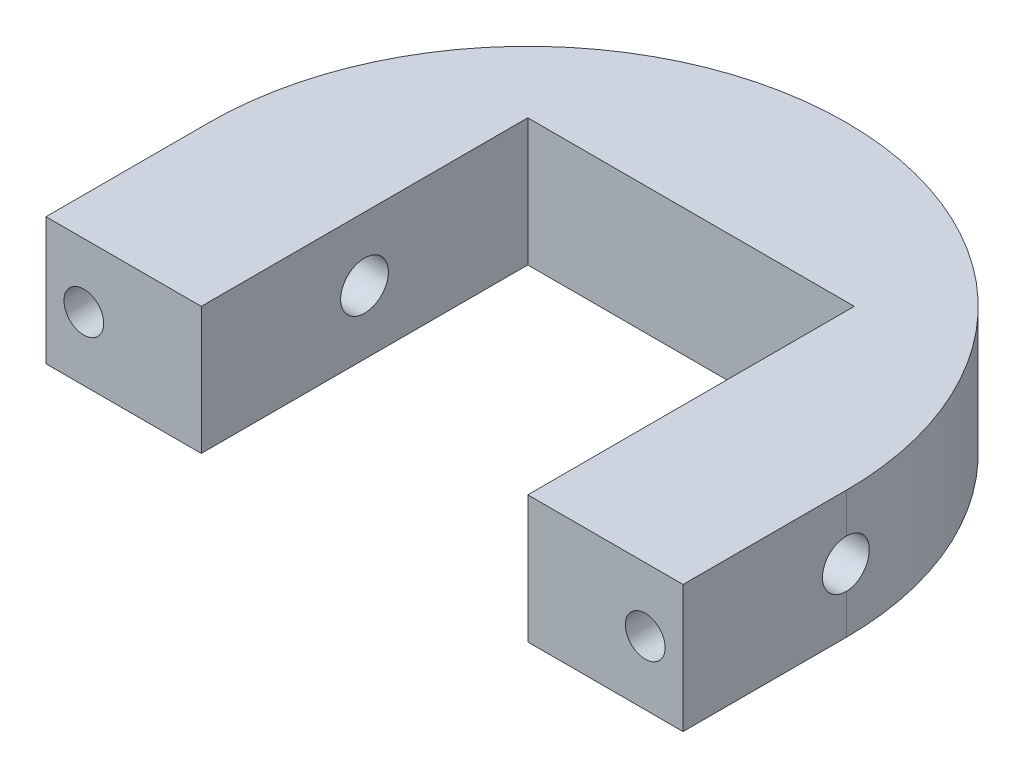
ISO-10303-21;
HEADER;
FILE_DESCRIPTION(('STEP AP214'),'2;1');
FILE_NAME('part.step','',(''),(''),'','','');
FILE_SCHEMA(('AUTOMOTIVE_DESIGN { 1 0 10303 214 1 1 1 1 }'));
ENDSEC;
DATA;
#1=APPLICATION_CONTEXT('core data for automotive mechanical design processes');
#2=APPLICATION_PROTOCOL_DEFINITION('international standard','automotive_design',2000,#1);
#3=PRODUCT_CONTEXT('',#1,'mechanical');
#4=PRODUCT('Part','Part','',(#3));
#5=PRODUCT_RELATED_PRODUCT_CATEGORY('part','',(#4));
#6=PRODUCT_DEFINITION_FORMATION('','',#4);
#7=PRODUCT_DEFINITION_CONTEXT('part definition',#1,'design');
#8=PRODUCT_DEFINITION('design','',#6,#7);
#9=PRODUCT_DEFINITION_SHAPE('','',#8);
#10=(LENGTH_UNIT() NAMED_UNIT(*) SI_UNIT(.MILLI.,.METRE.));
#11=(NAMED_UNIT(*) PLANE_ANGLE_UNIT() SI_UNIT($,.RADIAN.));
#12=(NAMED_UNIT(*) SI_UNIT($,.STERADIAN.) SOLID_ANGLE_UNIT());
#13=UNCERTAINTY_MEASURE_WITH_UNIT(LENGTH_MEASURE(1.E-05),#10,'distance_accuracy_value','');
#14=(GEOMETRIC_REPRESENTATION_CONTEXT(3) GLOBAL_UNCERTAINTY_ASSIGNED_CONTEXT((#13)) GLOBAL_UNIT_ASSIGNED_CONTEXT((#10,
#11,#12)) REPRESENTATION_CONTEXT('',''));
#15=CARTESIAN_POINT('',(0.,0.,0.));
#16=DIRECTION('',(0.,0.,1.));
#17=DIRECTION('',(1.,0.,0.));
#18=AXIS2_PLACEMENT_3D('',#15,#16,#17);
#19=CARTESIAN_POINT('',(35.25,8.,7.87476235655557));
#20=DIRECTION('',(0.,0.,1.));
#21=DIRECTION('',(1.,0.,0.));
#22=AXIS2_PLACEMENT_3D('',#19,#20,#21);
#23=CONICAL_SURFACE('',#22,2.49999999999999,1.02974425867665);
#24=CARTESIAN_POINT('',(35.25,8.,6.37261080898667));
#25=VERTEX_POINT('',#24);
#26=VERTEX_LOOP('',#25);
#27=FACE_BOUND('',#26,.T.);
#28=CARTESIAN_POINT('',(35.25,8.,7.87476235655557));
#29=DIRECTION('',(0.,0.,1.));
#30=DIRECTION('',(1.,0.,0.));
#31=AXIS2_PLACEMENT_3D('',#28,#29,#30);
#32=CIRCLE('',#31,2.49999999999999);
#33=CARTESIAN_POINT('',(37.75,8.,7.87476235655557));
#34=VERTEX_POINT('',#33);
#35=EDGE_CURVE('E210',#34,#34,#32,.T.);
#36=ORIENTED_EDGE('',*,*,#35,.T.);
#37=EDGE_LOOP('',(#36));
#38=FACE_BOUND('',#37,.T.);
#39=ADVANCED_FACE('F33',(#27,#38),#23,.F.);
#40=CARTESIAN_POINT('',(35.25,8.,32.8747623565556));
#41=DIRECTION('',(0.,0.,1.));
#42=DIRECTION('',(1.,0.,0.));
#43=AXIS2_PLACEMENT_3D('',#40,#41,#42);
#44=CYLINDRICAL_SURFACE('',#43,2.49999999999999);
#45=CARTESIAN_POINT('',(35.25,8.,20.5));
#46=DIRECTION('',(0.,0.,-1.));
#47=DIRECTION('',(-1.,0.,0.));
#48=AXIS2_PLACEMENT_3D('',#45,#46,#47);
#49=CIRCLE('',#48,2.49999999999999);
#50=CARTESIAN_POINT('',(32.75,8.,20.5));
#51=VERTEX_POINT('',#50);
#52=EDGE_CURVE('E202',#51,#51,#49,.F.);
#53=ORIENTED_EDGE('',*,*,#52,.T.);
#54=EDGE_LOOP('',(#53));
#55=FACE_BOUND('',#54,.T.);
#56=ORIENTED_EDGE('',*,*,#35,.F.);
#57=EDGE_LOOP('',(#56));
#58=FACE_BOUND('',#57,.T.);
#59=ADVANCED_FACE('F256',(#55,#58),#44,.F.);
#60=CARTESIAN_POINT('',(40.,-15.,20.5));
#61=DIRECTION('',(0.,0.,-1.));
#62=DIRECTION('',(-1.,0.,0.));
#63=AXIS2_PLACEMENT_3D('',#60,#61,#62);
#64=PLANE('',#63);
#65=DIRECTION('',(-1.,0.,0.));
#66=VECTOR('',#65,1.);
#67=CARTESIAN_POINT('',(0.,16.,20.5));
#68=LINE('',#67,#66);
#69=CARTESIAN_POINT('',(40.,16.,20.5));
#70=VERTEX_POINT('',#69);
#71=CARTESIAN_POINT('',(20.5,16.,20.5));
#72=VERTEX_POINT('',#71);
#73=EDGE_CURVE('E205',#70,#72,#68,.T.);
#74=ORIENTED_EDGE('',*,*,#73,.T.);
#75=DIRECTION('',(0.,1.,0.));
#76=VECTOR('',#75,1.);
#77=CARTESIAN_POINT('',(20.5,0.,20.5));
#78=LINE('',#77,#76);
#79=CARTESIAN_POINT('',(20.5,0.,20.5));
#80=VERTEX_POINT('',#79);
#81=EDGE_CURVE('E175',#80,#72,#78,.T.);
#82=ORIENTED_EDGE('',*,*,#81,.F.);
#83=DIRECTION('',(-1.,0.,0.));
#84=VECTOR('',#83,1.);
#85=CARTESIAN_POINT('',(0.,0.,20.5));
#86=LINE('',#85,#84);
#87=CARTESIAN_POINT('',(40.,0.,20.5));
#88=VERTEX_POINT('',#87);
#89=EDGE_CURVE('E58',#88,#80,#86,.T.);
#90=ORIENTED_EDGE('',*,*,#89,.F.);
#91=DIRECTION('',(0.,1.,0.));
#92=VECTOR('',#91,1.);
#93=CARTESIAN_POINT('',(40.,-15.,20.5));
#94=LINE('',#93,#92);
#95=EDGE_CURVE('E134',#88,#70,#94,.T.);
#96=ORIENTED_EDGE('',*,*,#95,.T.);
#97=EDGE_LOOP('',(#74,#82,#90,#96));
#98=FACE_BOUND('',#97,.T.);
#99=ORIENTED_EDGE('',*,*,#52,.F.);
#100=EDGE_LOOP('',(#99));
#101=FACE_BOUND('',#100,.T.);
#102=ADVANCED_FACE('F261',(#98,#101),#64,.F.);
#103=CARTESIAN_POINT('',(0.,16.,0.));
#104=DIRECTION('',(0.,-1.,0.));
#105=DIRECTION('',(0.,0.,-1.));
#106=AXIS2_PLACEMENT_3D('',#103,#104,#105);
#107=CYLINDRICAL_SURFACE('',#106,40.);
#108=DIRECTION('',(0.,1.,0.));
#109=VECTOR('',#108,1.);
#110=CARTESIAN_POINT('',(40.,-86.4913290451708,0.));
#111=LINE('',#110,#109);
#112=CARTESIAN_POINT('',(40.,11.,0.));
#113=VERTEX_POINT('',#112);
#114=CARTESIAN_POINT('',(40.,16.,0.));
#115=VERTEX_POINT('',#114);
#116=EDGE_CURVE('E145',#113,#115,#111,.T.);
#117=ORIENTED_EDGE('',*,*,#116,.F.);
#118=CARTESIAN_POINT('',(40.,11.,0.));
#119=CARTESIAN_POINT('',(40.0000025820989,11.0000082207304,-0.0842519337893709));
#120=CARTESIAN_POINT('',(39.999733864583,10.9964508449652,-0.168499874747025));
#121=CARTESIAN_POINT('',(39.998672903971,10.9822685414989,-0.336390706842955));
#122=CARTESIAN_POINT('',(39.997880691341,10.9716440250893,-0.420033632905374));
#123=CARTESIAN_POINT('',(39.9957926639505,10.9434026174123,-0.586059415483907));
#124=CARTESIAN_POINT('',(39.9944972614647,10.9257914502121,-0.668443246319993));
#125=CARTESIAN_POINT('',(39.9914417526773,10.883721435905,-0.831410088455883));
#126=CARTESIAN_POINT('',(39.989681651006,10.8592626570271,-0.911993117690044));
#127=CARTESIAN_POINT('',(39.9837722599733,10.7758194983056,-1.15025422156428));
#128=CARTESIAN_POINT('',(39.9789928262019,10.7067548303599,-1.30452302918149));
#129=CARTESIAN_POINT('',(39.9682934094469,10.543823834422,-1.59916835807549));
#130=CARTESIAN_POINT('',(39.9623736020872,10.4499613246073,-1.73954701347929));
#131=CARTESIAN_POINT('',(39.9500441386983,10.2398690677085,-2.00284405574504));
#132=CARTESIAN_POINT('',(39.9436336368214,10.1236001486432,-2.12573119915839));
#133=CARTESIAN_POINT('',(39.9310518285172,9.87206977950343,-2.35027392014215));
#134=CARTESIAN_POINT('',(39.9248805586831,9.73680543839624,-2.45192625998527));
#135=CARTESIAN_POINT('',(39.9134669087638,9.45094083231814,-2.63120995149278));
#136=CARTESIAN_POINT('',(39.9082256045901,9.30032311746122,-2.70881355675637));
#137=CARTESIAN_POINT('',(39.899274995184,8.98815933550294,-2.83761304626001));
#138=CARTESIAN_POINT('',(39.8955655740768,8.82661409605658,-2.88881092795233));
#139=CARTESIAN_POINT('',(39.8901052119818,8.49749425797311,-2.96326025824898));
#140=CARTESIAN_POINT('',(39.8883506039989,8.3299315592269,-2.98656403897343));
#141=CARTESIAN_POINT('',(39.8869867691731,7.99326026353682,-3.00472522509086));
#142=CARTESIAN_POINT('',(39.8873775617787,7.82415165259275,-2.99958237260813));
#143=CARTESIAN_POINT('',(39.8902571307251,7.48955598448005,-2.96103864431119));
#144=CARTESIAN_POINT('',(39.8927416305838,7.32406225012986,-2.92769536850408));
#145=CARTESIAN_POINT('',(39.8995219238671,7.0010278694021,-2.83378680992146));
#146=CARTESIAN_POINT('',(39.9038177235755,6.84348725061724,-2.77322143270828));
#147=CARTESIAN_POINT('',(39.9137415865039,6.54064304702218,-2.62652168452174));
#148=CARTESIAN_POINT('',(39.9193710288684,6.39535234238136,-2.54036082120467));
#149=CARTESIAN_POINT('',(39.9313261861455,6.12128065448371,-2.34493899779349));
#150=CARTESIAN_POINT('',(39.9376518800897,5.99249917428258,-2.23567873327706));
#151=CARTESIAN_POINT('',(39.9503050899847,5.75477592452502,-1.99685373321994));
#152=CARTESIAN_POINT('',(39.9566325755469,5.64588129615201,-1.86724207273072));
#153=CARTESIAN_POINT('',(39.9685642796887,5.45135495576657,-1.59150157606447));
#154=CARTESIAN_POINT('',(39.9741682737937,5.36573045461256,-1.44536763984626));
#155=CARTESIAN_POINT('',(39.9840229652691,5.22018178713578,-1.14068220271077));
#156=CARTESIAN_POINT('',(39.9882727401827,5.16027512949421,-0.982122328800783));
#157=CARTESIAN_POINT('',(39.9949278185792,5.06803781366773,-0.657276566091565));
#158=CARTESIAN_POINT('',(39.9973359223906,5.03566528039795,-0.491002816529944));
#159=CARTESIAN_POINT('',(39.9991276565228,5.01165189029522,-0.269659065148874));
#160=CARTESIAN_POINT('',(39.9994546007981,5.00728019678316,-0.215772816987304));
#161=CARTESIAN_POINT('',(39.9998904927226,5.00145821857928,-0.107931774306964));
#162=CARTESIAN_POINT('',(39.9999998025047,5.00000308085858,-0.053977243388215));
#163=CARTESIAN_POINT('',(40.,5.,0.));
#164=B_SPLINE_CURVE_WITH_KNOTS('',3,(#118,#119,#120,#121,#122,#123,#124,#125,#126,#127,#128,
#129,#130,#131,#132,#133,#134,#135,#136,#137,#138,#139,#140,#141,#142,#143,#144,#145,#146,#147,
#148,#149,#150,#151,#152,#153,#154,#155,#156,#157,#158,#159,#160,#161,#162,#163),.UNSPECIFIED.,
.F.,.F.,(4,2,2,2,2,2,2,2,2,2,2,2,2,2,2,2,2,2,2,2,2,2,4),(0.,0.252673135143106,0.505331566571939,
0.757783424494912,1.01023276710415,1.51489486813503,2.01947931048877,2.52495402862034,
3.03050576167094,3.53663862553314,4.04273319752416,4.5478767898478,5.0530249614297,
5.55714384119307,6.06126446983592,6.56590871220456,7.07053776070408,7.57634791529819,
8.08231463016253,8.58862526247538,9.09416449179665,9.25630110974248,9.41816771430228),.UNSPECIFIED.);
#165=CARTESIAN_POINT('',(40.,5.,0.));
#166=VERTEX_POINT('',#165);
#167=EDGE_CURVE('E148',#113,#166,#164,.T.);
#168=ORIENTED_EDGE('',*,*,#167,.T.);
#169=CARTESIAN_POINT('',(40.,0.,0.));
#170=VERTEX_POINT('',#169);
#171=EDGE_CURVE('E141',#170,#166,#111,.T.);
#172=ORIENTED_EDGE('',*,*,#171,.F.);
#173=CARTESIAN_POINT('',(0.,0.,0.));
#174=DIRECTION('',(0.,1.,0.));
#175=DIRECTION('',(0.,0.,1.));
#176=AXIS2_PLACEMENT_3D('',#173,#174,#175);
#177=CIRCLE('',#176,40.);
#178=CARTESIAN_POINT('',(-40.,0.,0.));
#179=VERTEX_POINT('',#178);
#180=EDGE_CURVE('E178',#170,#179,#177,.T.);
#181=ORIENTED_EDGE('',*,*,#180,.T.);
#182=DIRECTION('',(0.,1.,0.));
#183=VECTOR('',#182,1.);
#184=CARTESIAN_POINT('',(-40.,-86.4913290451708,0.));
#185=LINE('',#184,#183);
#186=CARTESIAN_POINT('',(-40.,5.,0.));
#187=VERTEX_POINT('',#186);
#188=EDGE_CURVE('E140',#179,#187,#185,.T.);
#189=ORIENTED_EDGE('',*,*,#188,.T.);
#190=CARTESIAN_POINT('',(-40.,5.,0.));
#191=CARTESIAN_POINT('',(-40.0000025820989,4.99999177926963,-0.0842519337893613));
#192=CARTESIAN_POINT('',(-39.999733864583,5.00354915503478,-0.168499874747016));
#193=CARTESIAN_POINT('',(-39.998672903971,5.01773145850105,-0.336390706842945));
#194=CARTESIAN_POINT('',(-39.997880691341,5.0283559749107,-0.420033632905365));
#195=CARTESIAN_POINT('',(-39.9957926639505,5.05659738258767,-0.586059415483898));
#196=CARTESIAN_POINT('',(-39.9944972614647,5.07420854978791,-0.668443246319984));
#197=CARTESIAN_POINT('',(-39.9914417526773,5.11627856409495,-0.831410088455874));
#198=CARTESIAN_POINT('',(-39.989681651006,5.14073734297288,-0.911993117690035));
#199=CARTESIAN_POINT('',(-39.9837722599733,5.22418050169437,-1.15025422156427));
#200=CARTESIAN_POINT('',(-39.9789928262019,5.29324516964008,-1.30452302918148));
#201=CARTESIAN_POINT('',(-39.9682934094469,5.45617616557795,-1.59916835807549));
#202=CARTESIAN_POINT('',(-39.9623736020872,5.55003867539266,-1.73954701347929));
#203=CARTESIAN_POINT('',(-39.9500441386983,5.76013093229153,-2.00284405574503));
#204=CARTESIAN_POINT('',(-39.9436336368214,5.87639985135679,-2.12573119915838));
#205=CARTESIAN_POINT('',(-39.9310518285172,6.12793022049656,-2.35027392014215));
#206=CARTESIAN_POINT('',(-39.9248805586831,6.26319456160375,-2.45192625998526));
#207=CARTESIAN_POINT('',(-39.9134669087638,6.54905916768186,-2.63120995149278));
#208=CARTESIAN_POINT('',(-39.9082256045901,6.69967688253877,-2.70881355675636));
#209=CARTESIAN_POINT('',(-39.899274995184,7.01184066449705,-2.83761304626));
#210=CARTESIAN_POINT('',(-39.8955655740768,7.17338590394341,-2.88881092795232));
#211=CARTESIAN_POINT('',(-39.8901052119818,7.50250574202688,-2.96326025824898));
#212=CARTESIAN_POINT('',(-39.8883506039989,7.67006844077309,-2.98656403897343));
#213=CARTESIAN_POINT('',(-39.8869867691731,8.00673973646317,-3.00472522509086));
#214=CARTESIAN_POINT('',(-39.8873775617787,8.17584834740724,-2.99958237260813));
#215=CARTESIAN_POINT('',(-39.8902571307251,8.51044401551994,-2.96103864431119));
#216=CARTESIAN_POINT('',(-39.8927416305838,8.67593774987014,-2.92769536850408));
#217=CARTESIAN_POINT('',(-39.8995219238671,8.99897213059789,-2.83378680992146));
#218=CARTESIAN_POINT('',(-39.9038177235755,9.15651274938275,-2.77322143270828));
#219=CARTESIAN_POINT('',(-39.9137415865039,9.45935695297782,-2.62652168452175));
#220=CARTESIAN_POINT('',(-39.9193710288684,9.60464765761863,-2.54036082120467));
#221=CARTESIAN_POINT('',(-39.9313261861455,9.87871934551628,-2.3449389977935));
#222=CARTESIAN_POINT('',(-39.9376518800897,10.0075008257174,-2.23567873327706));
#223=CARTESIAN_POINT('',(-39.9503050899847,10.245224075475,-1.99685373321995));
#224=CARTESIAN_POINT('',(-39.9566325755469,10.354118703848,-1.86724207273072));
#225=CARTESIAN_POINT('',(-39.9685642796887,10.5486450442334,-1.59150157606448));
#226=CARTESIAN_POINT('',(-39.9741682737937,10.6342695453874,-1.44536763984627));
#227=CARTESIAN_POINT('',(-39.9840229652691,10.7798182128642,-1.14068220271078));
#228=CARTESIAN_POINT('',(-39.9882727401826,10.8397248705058,-0.982122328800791));
#229=CARTESIAN_POINT('',(-39.9949278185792,10.9319621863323,-0.657276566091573));
#230=CARTESIAN_POINT('',(-39.9973359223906,10.964334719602,-0.491002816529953));
#231=CARTESIAN_POINT('',(-39.9991276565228,10.9883481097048,-0.26965906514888));
#232=CARTESIAN_POINT('',(-39.9994546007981,10.9927198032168,-0.215772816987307));
#233=CARTESIAN_POINT('',(-39.9998904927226,10.9985417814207,-0.107931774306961));
#234=CARTESIAN_POINT('',(-39.9999998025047,10.9999969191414,-0.0539772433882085));
#235=CARTESIAN_POINT('',(-40.,11.,0.));
#236=B_SPLINE_CURVE_WITH_KNOTS('',3,(#190,#191,#192,#193,#194,#195,#196,#197,#198,#199,#200,
#201,#202,#203,#204,#205,#206,#207,#208,#209,#210,#211,#212,#213,#214,#215,#216,#217,#218,#219,
#220,#221,#222,#223,#224,#225,#226,#227,#228,#229,#230,#231,#232,#233,#234,#235),.UNSPECIFIED.,
.F.,.F.,(4,2,2,2,2,2,2,2,2,2,2,2,2,2,2,2,2,2,2,2,2,2,4),(0.,0.252673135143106,0.505331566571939,
0.757783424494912,1.01023276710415,1.51489486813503,2.01947931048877,2.52495402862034,
3.03050576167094,3.53663862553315,4.04273319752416,4.5478767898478,5.0530249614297,
5.55714384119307,6.06126446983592,6.56590871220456,7.07053776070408,7.57634791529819,
8.08231463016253,8.58862526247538,9.09416449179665,9.25630110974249,9.4181677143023),.UNSPECIFIED.);
#237=CARTESIAN_POINT('',(-40.,11.,0.));
#238=VERTEX_POINT('',#237);
#239=EDGE_CURVE('E220',#187,#238,#236,.T.);
#240=ORIENTED_EDGE('',*,*,#239,.T.);
#241=CARTESIAN_POINT('',(-40.,16.,0.));
#242=VERTEX_POINT('',#241);
#243=EDGE_CURVE('E158',#238,#242,#185,.T.);
#244=ORIENTED_EDGE('',*,*,#243,.T.);
#245=CARTESIAN_POINT('',(0.,16.,0.));
#246=DIRECTION('',(0.,1.,0.));
#247=DIRECTION('',(0.,0.,1.));
#248=AXIS2_PLACEMENT_3D('',#245,#246,#247);
#249=CIRCLE('',#248,40.);
#250=EDGE_CURVE('E43',#115,#242,#249,.T.);
#251=ORIENTED_EDGE('',*,*,#250,.F.);
#252=EDGE_LOOP('',(#117,#168,#172,#181,#189,#240,#244,#251));
#253=FACE_BOUND('',#252,.T.);
#254=ADVANCED_FACE('F35',(#253),#107,.T.);
#255=CARTESIAN_POINT('',(0.,16.,0.));
#256=DIRECTION('',(0.,1.,0.));
#257=DIRECTION('',(0.,0.,1.));
#258=AXIS2_PLACEMENT_3D('',#255,#256,#257);
#259=PLANE('',#258);
#260=ORIENTED_EDGE('',*,*,#73,.F.);
#261=DIRECTION('',(0.,0.,-1.));
#262=VECTOR('',#261,1.);
#263=CARTESIAN_POINT('',(40.,16.,0.));
#264=LINE('',#263,#262);
#265=EDGE_CURVE('E157',#70,#115,#264,.T.);
#266=ORIENTED_EDGE('',*,*,#265,.T.);
#267=ORIENTED_EDGE('',*,*,#250,.T.);
#268=DIRECTION('',(0.,0.,1.));
#269=VECTOR('',#268,1.);
#270=CARTESIAN_POINT('',(-40.,16.,0.));
#271=LINE('',#270,#269);
#272=CARTESIAN_POINT('',(-40.,16.,20.5));
#273=VERTEX_POINT('',#272);
#274=EDGE_CURVE('E155',#242,#273,#271,.T.);
#275=ORIENTED_EDGE('',*,*,#274,.T.);
#276=CARTESIAN_POINT('',(-20.5,16.,20.5));
#277=VERTEX_POINT('',#276);
#278=EDGE_CURVE('E50',#277,#273,#68,.T.);
#279=ORIENTED_EDGE('',*,*,#278,.F.);
#280=DIRECTION('',(0.,0.,1.));
#281=VECTOR('',#280,1.);
#282=CARTESIAN_POINT('',(-20.5,16.,20.5));
#283=LINE('',#282,#281);
#284=CARTESIAN_POINT('',(-20.5,16.,-20.5));
#285=VERTEX_POINT('',#284);
#286=EDGE_CURVE('E164',#285,#277,#283,.T.);
#287=ORIENTED_EDGE('',*,*,#286,.F.);
#288=DIRECTION('',(-1.,0.,0.));
#289=VECTOR('',#288,1.);
#290=CARTESIAN_POINT('',(20.5,16.,-20.5));
#291=LINE('',#290,#289);
#292=CARTESIAN_POINT('',(20.5,16.,-20.5));
#293=VERTEX_POINT('',#292);
#294=EDGE_CURVE('E170',#293,#285,#291,.T.);
#295=ORIENTED_EDGE('',*,*,#294,.F.);
#296=DIRECTION('',(0.,0.,-1.));
#297=VECTOR('',#296,1.);
#298=CARTESIAN_POINT('',(20.5,16.,20.5));
#299=LINE('',#298,#297);
#300=EDGE_CURVE('E168',#72,#293,#299,.T.);
#301=ORIENTED_EDGE('',*,*,#300,.F.);
#302=EDGE_LOOP('',(#260,#266,#267,#275,#279,#287,#295,#301));
#303=FACE_BOUND('',#302,.T.);
#304=ADVANCED_FACE('F249',(#303),#259,.T.);
#305=CARTESIAN_POINT('',(0.,0.,0.));
#306=DIRECTION('',(0.,1.,0.));
#307=DIRECTION('',(0.,0.,1.));
#308=AXIS2_PLACEMENT_3D('',#305,#306,#307);
#309=PLANE('',#308);
#310=DIRECTION('',(0.,0.,1.));
#311=VECTOR('',#310,1.);
#312=CARTESIAN_POINT('',(40.,0.,0.));
#313=LINE('',#312,#311);
#314=EDGE_CURVE('E126',#170,#88,#313,.T.);
#315=ORIENTED_EDGE('',*,*,#314,.T.);
#316=ORIENTED_EDGE('',*,*,#89,.T.);
#317=DIRECTION('',(0.,0.,-1.));
#318=VECTOR('',#317,1.);
#319=CARTESIAN_POINT('',(20.5,0.,20.5));
#320=LINE('',#319,#318);
#321=CARTESIAN_POINT('',(20.5,0.,-20.5));
#322=VERTEX_POINT('',#321);
#323=EDGE_CURVE('E161',#80,#322,#320,.T.);
#324=ORIENTED_EDGE('',*,*,#323,.T.);
#325=DIRECTION('',(-1.,0.,0.));
#326=VECTOR('',#325,1.);
#327=CARTESIAN_POINT('',(20.5,0.,-20.5));
#328=LINE('',#327,#326);
#329=CARTESIAN_POINT('',(-20.5,0.,-20.5));
#330=VERTEX_POINT('',#329);
#331=EDGE_CURVE('E163',#322,#330,#328,.T.);
#332=ORIENTED_EDGE('',*,*,#331,.T.);
#333=DIRECTION('',(0.,0.,1.));
#334=VECTOR('',#333,1.);
#335=CARTESIAN_POINT('',(-20.5,0.,20.5));
#336=LINE('',#335,#334);
#337=CARTESIAN_POINT('',(-20.5,0.,20.5));
#338=VERTEX_POINT('',#337);
#339=EDGE_CURVE('E124',#330,#338,#336,.T.);
#340=ORIENTED_EDGE('',*,*,#339,.T.);
#341=CARTESIAN_POINT('',(-40.,0.,20.5));
#342=VERTEX_POINT('',#341);
#343=EDGE_CURVE('E117',#338,#342,#86,.T.);
#344=ORIENTED_EDGE('',*,*,#343,.T.);
#345=DIRECTION('',(0.,0.,-1.));
#346=VECTOR('',#345,1.);
#347=CARTESIAN_POINT('',(-40.,0.,0.));
#348=LINE('',#347,#346);
#349=EDGE_CURVE('E121',#342,#179,#348,.T.);
#350=ORIENTED_EDGE('',*,*,#349,.T.);
#351=ORIENTED_EDGE('',*,*,#180,.F.);
#352=EDGE_LOOP('',(#315,#316,#324,#332,#340,#344,#350,#351));
#353=FACE_BOUND('',#352,.T.);
#354=ADVANCED_FACE('F119',(#353),#309,.F.);
#355=CARTESIAN_POINT('',(20.5,0.,20.5));
#356=DIRECTION('',(1.,0.,0.));
#357=DIRECTION('',(0.,0.,-1.));
#358=AXIS2_PLACEMENT_3D('',#355,#356,#357);
#359=PLANE('',#358);
#360=CARTESIAN_POINT('',(20.5,8.,0.));
#361=DIRECTION('',(1.,0.,0.));
#362=DIRECTION('',(0.,0.,-1.));
#363=AXIS2_PLACEMENT_3D('',#360,#361,#362);
#364=CIRCLE('',#363,3.);
#365=CARTESIAN_POINT('',(20.5,8.,-3.));
#366=VERTEX_POINT('',#365);
#367=EDGE_CURVE('E218',#366,#366,#364,.T.);
#368=ORIENTED_EDGE('',*,*,#367,.T.);
#369=EDGE_LOOP('',(#368));
#370=FACE_BOUND('',#369,.T.);
#371=DIRECTION('',(0.,1.,0.));
#372=VECTOR('',#371,1.);
#373=CARTESIAN_POINT('',(20.5,0.,-20.5));
#374=LINE('',#373,#372);
#375=EDGE_CURVE('E167',#322,#293,#374,.T.);
#376=ORIENTED_EDGE('',*,*,#375,.F.);
#377=ORIENTED_EDGE('',*,*,#323,.F.);
#378=ORIENTED_EDGE('',*,*,#81,.T.);
#379=ORIENTED_EDGE('',*,*,#300,.T.);
#380=EDGE_LOOP('',(#376,#377,#378,#379));
#381=FACE_BOUND('',#380,.T.);
#382=ADVANCED_FACE('F241',(#370,#381),#359,.F.);
#383=CARTESIAN_POINT('',(-20.5,0.,20.5));
#384=DIRECTION('',(-1.,0.,0.));
#385=DIRECTION('',(0.,0.,1.));
#386=AXIS2_PLACEMENT_3D('',#383,#384,#385);
#387=PLANE('',#386);
#388=CARTESIAN_POINT('',(-20.5,8.,0.));
#389=DIRECTION('',(-1.,0.,0.));
#390=DIRECTION('',(0.,0.,1.));
#391=AXIS2_PLACEMENT_3D('',#388,#389,#390);
#392=CIRCLE('',#391,3.);
#393=CARTESIAN_POINT('',(-20.5,8.,3.));
#394=VERTEX_POINT('',#393);
#395=EDGE_CURVE('E215',#394,#394,#392,.T.);
#396=ORIENTED_EDGE('',*,*,#395,.T.);
#397=EDGE_LOOP('',(#396));
#398=FACE_BOUND('',#397,.T.);
#399=ORIENTED_EDGE('',*,*,#286,.T.);
#400=DIRECTION('',(0.,1.,0.));
#401=VECTOR('',#400,1.);
#402=CARTESIAN_POINT('',(-20.5,0.,20.5));
#403=LINE('',#402,#401);
#404=EDGE_CURVE('E179',#338,#277,#403,.T.);
#405=ORIENTED_EDGE('',*,*,#404,.F.);
#406=ORIENTED_EDGE('',*,*,#339,.F.);
#407=DIRECTION('',(0.,1.,0.));
#408=VECTOR('',#407,1.);
#409=CARTESIAN_POINT('',(-20.5,0.,-20.5));
#410=LINE('',#409,#408);
#411=EDGE_CURVE('E181',#330,#285,#410,.T.);
#412=ORIENTED_EDGE('',*,*,#411,.T.);
#413=EDGE_LOOP('',(#399,#405,#406,#412));
#414=FACE_BOUND('',#413,.T.);
#415=ADVANCED_FACE('F238',(#398,#414),#387,.F.);
#416=CARTESIAN_POINT('',(20.5,0.,-20.5));
#417=DIRECTION('',(0.,0.,-1.));
#418=DIRECTION('',(-1.,0.,0.));
#419=AXIS2_PLACEMENT_3D('',#416,#417,#418);
#420=PLANE('',#419);
#421=ORIENTED_EDGE('',*,*,#294,.T.);
#422=ORIENTED_EDGE('',*,*,#411,.F.);
#423=ORIENTED_EDGE('',*,*,#331,.F.);
#424=ORIENTED_EDGE('',*,*,#375,.T.);
#425=EDGE_LOOP('',(#421,#422,#423,#424));
#426=FACE_BOUND('',#425,.T.);
#427=ADVANCED_FACE('F237',(#426),#420,.F.);
#428=CARTESIAN_POINT('',(-40.,-86.4913290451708,0.));
#429=DIRECTION('',(-1.,0.,0.));
#430=DIRECTION('',(0.,0.,1.));
#431=AXIS2_PLACEMENT_3D('',#428,#429,#430);
#432=PLANE('',#431);
#433=DIRECTION('',(0.,1.,0.));
#434=VECTOR('',#433,1.);
#435=CARTESIAN_POINT('',(-40.,-15.,20.5));
#436=LINE('',#435,#434);
#437=EDGE_CURVE('E128',#342,#273,#436,.T.);
#438=ORIENTED_EDGE('',*,*,#437,.T.);
#439=ORIENTED_EDGE('',*,*,#274,.F.);
#440=ORIENTED_EDGE('',*,*,#243,.F.);
#441=CARTESIAN_POINT('',(-40.,8.,0.));
#442=DIRECTION('',(-1.,0.,0.));
#443=DIRECTION('',(0.,0.,1.));
#444=AXIS2_PLACEMENT_3D('',#441,#442,#443);
#445=CIRCLE('',#444,3.);
#446=EDGE_CURVE('E213',#187,#238,#445,.T.);
#447=ORIENTED_EDGE('',*,*,#446,.F.);
#448=ORIENTED_EDGE('',*,*,#188,.F.);
#449=ORIENTED_EDGE('',*,*,#349,.F.);
#450=EDGE_LOOP('',(#438,#439,#440,#447,#448,#449));
#451=FACE_BOUND('',#450,.T.);
#452=ADVANCED_FACE('F137',(#451),#432,.T.);
#453=CARTESIAN_POINT('',(40.,-86.4913290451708,0.));
#454=DIRECTION('',(1.,0.,0.));
#455=DIRECTION('',(0.,0.,-1.));
#456=AXIS2_PLACEMENT_3D('',#453,#454,#455);
#457=PLANE('',#456);
#458=ORIENTED_EDGE('',*,*,#95,.F.);
#459=ORIENTED_EDGE('',*,*,#314,.F.);
#460=ORIENTED_EDGE('',*,*,#171,.T.);
#461=CARTESIAN_POINT('',(40.,8.,0.));
#462=DIRECTION('',(1.,0.,0.));
#463=DIRECTION('',(0.,0.,-1.));
#464=AXIS2_PLACEMENT_3D('',#461,#462,#463);
#465=CIRCLE('',#464,3.);
#466=EDGE_CURVE('E11',#113,#166,#465,.T.);
#467=ORIENTED_EDGE('',*,*,#466,.F.);
#468=ORIENTED_EDGE('',*,*,#116,.T.);
#469=ORIENTED_EDGE('',*,*,#265,.F.);
#470=EDGE_LOOP('',(#458,#459,#460,#467,#468,#469));
#471=FACE_BOUND('',#470,.T.);
#472=ADVANCED_FACE('F195',(#471),#457,.T.);
#473=CARTESIAN_POINT('',(40.,8.,0.));
#474=DIRECTION('',(-1.,0.,0.));
#475=DIRECTION('',(0.,0.,1.));
#476=AXIS2_PLACEMENT_3D('',#473,#474,#475);
#477=CYLINDRICAL_SURFACE('',#476,3.);
#478=ORIENTED_EDGE('',*,*,#367,.F.);
#479=EDGE_LOOP('',(#478));
#480=FACE_BOUND('',#479,.T.);
#481=ORIENTED_EDGE('',*,*,#466,.T.);
#482=ORIENTED_EDGE('',*,*,#167,.F.);
#483=EDGE_LOOP('',(#481,#482));
#484=FACE_BOUND('',#483,.T.);
#485=ADVANCED_FACE('F224',(#480,#484),#477,.F.);
#486=ORIENTED_EDGE('',*,*,#395,.F.);
#487=EDGE_LOOP('',(#486));
#488=FACE_BOUND('',#487,.T.);
#489=ORIENTED_EDGE('',*,*,#446,.T.);
#490=ORIENTED_EDGE('',*,*,#239,.F.);
#491=EDGE_LOOP('',(#489,#490));
#492=FACE_BOUND('',#491,.T.);
#493=ADVANCED_FACE('F229',(#488,#492),#477,.F.);
#494=ORIENTED_EDGE('',*,*,#278,.T.);
#495=ORIENTED_EDGE('',*,*,#437,.F.);
#496=ORIENTED_EDGE('',*,*,#343,.F.);
#497=ORIENTED_EDGE('',*,*,#404,.T.);
#498=EDGE_LOOP('',(#494,#495,#496,#497));
#499=FACE_BOUND('',#498,.T.);
#500=CARTESIAN_POINT('',(-35.25,8.,20.5));
#501=DIRECTION('',(0.,0.,-1.));
#502=DIRECTION('',(-1.,0.,0.));
#503=AXIS2_PLACEMENT_3D('',#500,#501,#502);
#504=CIRCLE('',#503,2.49999999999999);
#505=CARTESIAN_POINT('',(-37.75,8.,20.5));
#506=VERTEX_POINT('',#505);
#507=EDGE_CURVE('E38',#506,#506,#504,.F.);
#508=ORIENTED_EDGE('',*,*,#507,.F.);
#509=EDGE_LOOP('',(#508));
#510=FACE_BOUND('',#509,.T.);
#511=ADVANCED_FACE('F129',(#499,#510),#64,.F.);
#512=CARTESIAN_POINT('',(-35.25,8.,7.87476235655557));
#513=DIRECTION('',(0.,0.,1.));
#514=DIRECTION('',(1.,0.,0.));
#515=AXIS2_PLACEMENT_3D('',#512,#513,#514);
#516=CONICAL_SURFACE('',#515,2.49999999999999,1.02974425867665);
#517=CARTESIAN_POINT('',(-35.25,8.,6.37261080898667));
#518=VERTEX_POINT('',#517);
#519=VERTEX_LOOP('',#518);
#520=FACE_BOUND('',#519,.T.);
#521=CARTESIAN_POINT('',(-35.25,8.,7.87476235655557));
#522=DIRECTION('',(0.,0.,1.));
#523=DIRECTION('',(1.,0.,0.));
#524=AXIS2_PLACEMENT_3D('',#521,#522,#523);
#525=CIRCLE('',#524,2.49999999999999);
#526=CARTESIAN_POINT('',(-32.75,8.,7.87476235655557));
#527=VERTEX_POINT('',#526);
#528=EDGE_CURVE('E207',#527,#527,#525,.T.);
#529=ORIENTED_EDGE('',*,*,#528,.T.);
#530=EDGE_LOOP('',(#529));
#531=FACE_BOUND('',#530,.T.);
#532=ADVANCED_FACE('F271',(#520,#531),#516,.F.);
#533=CARTESIAN_POINT('',(-35.25,8.,32.8747623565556));
#534=DIRECTION('',(0.,0.,1.));
#535=DIRECTION('',(1.,0.,0.));
#536=AXIS2_PLACEMENT_3D('',#533,#534,#535);
#537=CYLINDRICAL_SURFACE('',#536,2.49999999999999);
#538=ORIENTED_EDGE('',*,*,#507,.T.);
#539=EDGE_LOOP('',(#538));
#540=FACE_BOUND('',#539,.T.);
#541=ORIENTED_EDGE('',*,*,#528,.F.);
#542=EDGE_LOOP('',(#541));
#543=FACE_BOUND('',#542,.T.);
#544=ADVANCED_FACE('F274',(#540,#543),#537,.F.);
#545=CLOSED_SHELL('',(#39,#59,#102,#254,#304,#354,#382,#415,#427,#452,#472,#485,#493,#511,#532,#544));
#546=MANIFOLD_SOLID_BREP('B2',#545);
#547=ADVANCED_BREP_SHAPE_REPRESENTATION('',(#18,#546),#14);
#548=SHAPE_DEFINITION_REPRESENTATION(#9,#547);
ENDSEC;
END-ISO-10303-21;
